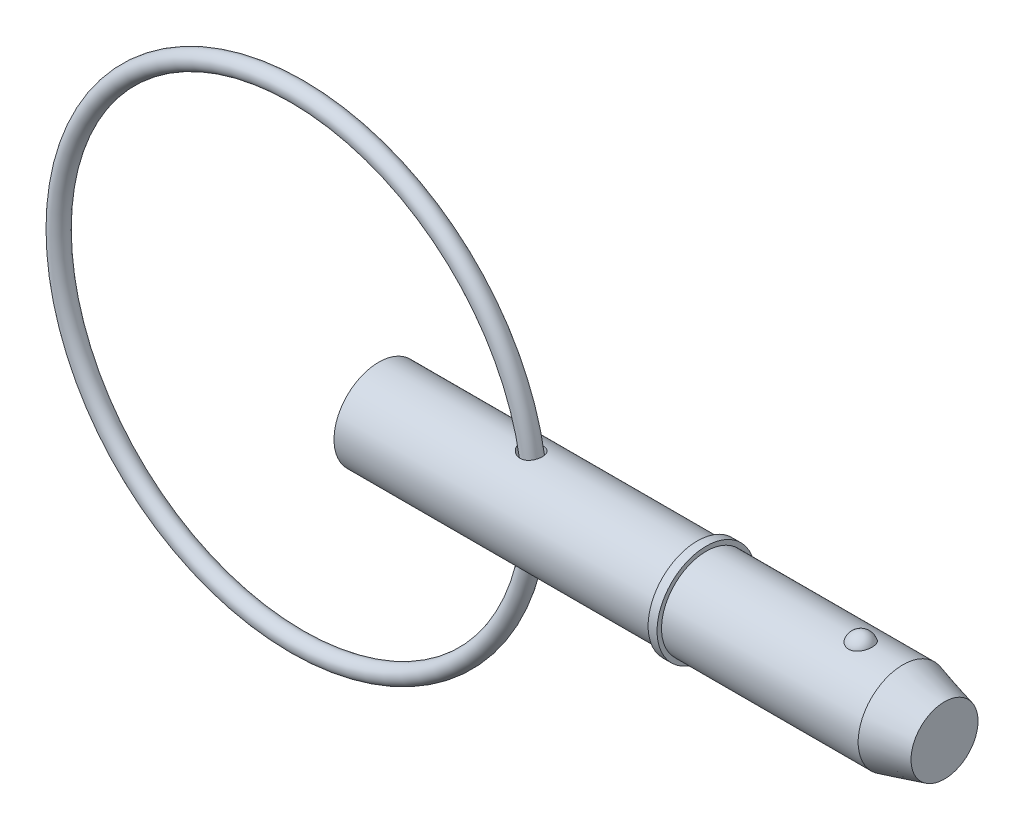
ISO-10303-21;
HEADER;
FILE_DESCRIPTION(('STEP AP214'),'2;1');
FILE_NAME('part.step','',(''),(''),'','','');
FILE_SCHEMA(('AUTOMOTIVE_DESIGN { 1 0 10303 214 1 1 1 1 }'));
ENDSEC;
DATA;
#1=APPLICATION_CONTEXT('core data for automotive mechanical design processes');
#2=APPLICATION_PROTOCOL_DEFINITION('international standard','automotive_design',2000,#1);
#3=PRODUCT_CONTEXT('',#1,'mechanical');
#4=PRODUCT('Part','Part','',(#3));
#5=PRODUCT_RELATED_PRODUCT_CATEGORY('part','',(#4));
#6=PRODUCT_DEFINITION_FORMATION('','',#4);
#7=PRODUCT_DEFINITION_CONTEXT('part definition',#1,'design');
#8=PRODUCT_DEFINITION('design','',#6,#7);
#9=PRODUCT_DEFINITION_SHAPE('','',#8);
#10=(LENGTH_UNIT() NAMED_UNIT(*) SI_UNIT(.MILLI.,.METRE.));
#11=(NAMED_UNIT(*) PLANE_ANGLE_UNIT() SI_UNIT($,.RADIAN.));
#12=(NAMED_UNIT(*) SI_UNIT($,.STERADIAN.) SOLID_ANGLE_UNIT());
#13=UNCERTAINTY_MEASURE_WITH_UNIT(LENGTH_MEASURE(1.E-05),#10,'distance_accuracy_value','');
#14=(GEOMETRIC_REPRESENTATION_CONTEXT(3) GLOBAL_UNCERTAINTY_ASSIGNED_CONTEXT((#13)) GLOBAL_UNIT_ASSIGNED_CONTEXT((#10,
#11,#12)) REPRESENTATION_CONTEXT('',''));
#15=CARTESIAN_POINT('',(0.,0.,0.));
#16=DIRECTION('',(0.,0.,1.));
#17=DIRECTION('',(1.,0.,0.));
#18=AXIS2_PLACEMENT_3D('',#15,#16,#17);
#19=CARTESIAN_POINT('',(-4.3552379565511,0.,0.));
#20=DIRECTION('',(0.,0.,1.));
#21=DIRECTION('',(1.,0.,0.));
#22=AXIS2_PLACEMENT_3D('',#19,#20,#21);
#23=TOROIDAL_SURFACE('',#22,12.7,0.476000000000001);
#24=CARTESIAN_POINT('',(8.8207620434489,0.,0.));
#25=VERTEX_POINT('',#24);
#26=VERTEX_LOOP('',#25);
#27=FACE_BOUND('',#26,.T.);
#28=ADVANCED_FACE('P0_F12',(#27),#23,.T.);
#29=CLOSED_SHELL('',(#28));
#30=MANIFOLD_SOLID_BREP('P0_B1',#29);
#31=CARTESIAN_POINT('',(0.,0.,0.));
#32=DIRECTION('',(1.,0.,0.));
#33=DIRECTION('',(0.,0.,-1.));
#34=AXIS2_PLACEMENT_3D('',#31,#32,#33);
#35=CYLINDRICAL_SURFACE('',#34,2.38);
#36=CARTESIAN_POINT('',(7.65248265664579,2.35074198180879,-0.372037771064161));
#37=CARTESIAN_POINT('',(7.67546616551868,2.34644965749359,-0.399158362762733));
#38=CARTESIAN_POINT('',(7.70081651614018,2.34199234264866,-0.424274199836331));
#39=CARTESIAN_POINT('',(7.75542747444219,2.33326580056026,-0.46990771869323));
#40=CARTESIAN_POINT('',(7.78469342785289,2.32899684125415,-0.49041900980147));
#41=CARTESIAN_POINT('',(7.8462833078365,2.32114904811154,-0.526312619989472));
#42=CARTESIAN_POINT('',(7.87860537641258,2.31756979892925,-0.541698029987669));
#43=CARTESIAN_POINT('',(7.9454452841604,2.31153734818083,-0.566889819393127));
#44=CARTESIAN_POINT('',(7.97996214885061,2.30908365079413,-0.576698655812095));
#45=CARTESIAN_POINT('',(8.05000735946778,2.30564492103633,-0.590297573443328));
#46=CARTESIAN_POINT('',(8.0855275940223,2.30465036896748,-0.594126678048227));
#47=CARTESIAN_POINT('',(8.15670718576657,2.30426876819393,-0.595606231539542));
#48=CARTESIAN_POINT('',(8.1923664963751,2.30488122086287,-0.593258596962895));
#49=CARTESIAN_POINT('',(8.26077822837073,2.30759475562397,-0.582609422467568));
#50=CARTESIAN_POINT('',(8.29358437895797,2.30961492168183,-0.574631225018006));
#51=CARTESIAN_POINT('',(8.35727060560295,2.31483318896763,-0.553233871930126));
#52=CARTESIAN_POINT('',(8.38815097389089,2.31803111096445,-0.53981554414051));
#53=CARTESIAN_POINT('',(8.44618254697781,2.3251225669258,-0.508384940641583));
#54=CARTESIAN_POINT('',(8.47341743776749,2.32899254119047,-0.490521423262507));
#55=CARTESIAN_POINT('',(8.5244826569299,2.33706025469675,-0.450515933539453));
#56=CARTESIAN_POINT('',(8.54831285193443,2.34125800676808,-0.428373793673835));
#57=CARTESIAN_POINT('',(8.5921621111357,2.34956202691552,-0.38020980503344));
#58=CARTESIAN_POINT('',(8.61214543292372,2.35366715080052,-0.354155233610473));
#59=CARTESIAN_POINT('',(8.64754725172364,2.36130301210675,-0.299034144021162));
#60=CARTESIAN_POINT('',(8.66296545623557,2.36483371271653,-0.269967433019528));
#61=CARTESIAN_POINT('',(8.68903776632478,2.37098548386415,-0.209215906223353));
#62=CARTESIAN_POINT('',(8.69962580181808,2.37359383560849,-0.177501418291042));
#63=CARTESIAN_POINT('',(8.71546966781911,2.37755210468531,-0.112692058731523));
#64=CARTESIAN_POINT('',(8.72072552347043,2.37890202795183,-0.0795971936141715));
#65=CARTESIAN_POINT('',(8.72577448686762,2.38019811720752,-0.0129544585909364));
#66=CARTESIAN_POINT('',(8.72556573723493,2.38014380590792,0.0205935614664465));
#67=CARTESIAN_POINT('',(8.71968604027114,2.37863606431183,0.0871753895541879));
#68=CARTESIAN_POINT('',(8.71401506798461,2.37718262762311,0.120209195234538));
#69=CARTESIAN_POINT('',(8.69736472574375,2.37303648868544,0.184779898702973));
#70=CARTESIAN_POINT('',(8.68639268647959,2.37034549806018,0.216318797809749));
#71=CARTESIAN_POINT('',(8.65941400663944,2.36401552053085,0.277063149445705));
#72=CARTESIAN_POINT('',(8.6434071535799,2.36037649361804,0.306268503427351));
#73=CARTESIAN_POINT('',(8.60670627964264,2.35253749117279,0.361595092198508));
#74=CARTESIAN_POINT('',(8.58600040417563,2.34833610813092,0.387708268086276));
#75=CARTESIAN_POINT('',(8.54044852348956,2.33984863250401,0.436017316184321));
#76=CARTESIAN_POINT('',(8.51560272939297,2.33556254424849,0.458213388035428));
#77=CARTESIAN_POINT('',(8.46260111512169,2.32742099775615,0.497916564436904));
#78=CARTESIAN_POINT('',(8.43446763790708,2.32356294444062,0.51545294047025));
#79=CARTESIAN_POINT('',(8.37555109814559,2.31668866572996,0.545520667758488));
#80=CARTESIAN_POINT('',(8.34476845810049,2.31367230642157,0.558052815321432));
#81=CARTESIAN_POINT('',(8.28194930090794,2.30886128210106,0.57763341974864));
#82=CARTESIAN_POINT('',(8.24993988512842,2.30704826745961,0.584764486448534));
#83=CARTESIAN_POINT('',(8.18514558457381,2.30475365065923,0.593744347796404));
#84=CARTESIAN_POINT('',(8.15236068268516,2.30427207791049,0.595593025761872));
#85=CARTESIAN_POINT('',(8.08670515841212,2.30466513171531,0.594069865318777));
#86=CARTESIAN_POINT('',(8.05383545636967,2.30554895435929,0.590662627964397));
#87=CARTESIAN_POINT('',(7.98908593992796,2.30856010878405,0.578780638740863));
#88=CARTESIAN_POINT('',(7.95720636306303,2.31068773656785,0.570304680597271));
#89=CARTESIAN_POINT('',(7.89377258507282,2.31605973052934,0.54809064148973));
#90=CARTESIAN_POINT('',(7.86230095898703,2.31935100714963,0.534128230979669));
#91=CARTESIAN_POINT('',(7.80205133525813,2.32664713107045,0.501391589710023));
#92=CARTESIAN_POINT('',(7.77327429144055,2.33065222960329,0.48261566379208));
#93=CARTESIAN_POINT('',(7.7179634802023,2.3391254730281,0.439760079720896));
#94=CARTESIAN_POINT('',(7.69158313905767,2.3436062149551,0.415484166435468));
#95=CARTESIAN_POINT('',(7.64339516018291,2.35235146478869,0.362706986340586));
#96=CARTESIAN_POINT('',(7.62158727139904,2.35661598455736,0.334205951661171));
#97=CARTESIAN_POINT('',(7.58382605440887,2.36432007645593,0.274368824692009));
#98=CARTESIAN_POINT('',(7.56774982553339,2.36777633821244,0.243112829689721));
#99=CARTESIAN_POINT('',(7.54152169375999,2.3735493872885,0.178112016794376));
#100=CARTESIAN_POINT('',(7.53136536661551,2.3758670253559,0.14436907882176));
#101=CARTESIAN_POINT('',(7.51809691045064,2.37891982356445,0.0783638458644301));
#102=CARTESIAN_POINT('',(7.5144720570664,2.37976992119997,0.0462095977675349));
#103=CARTESIAN_POINT('',(7.51285288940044,2.38014795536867,-0.0182487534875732));
#104=CARTESIAN_POINT('',(7.5148575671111,2.37967612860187,-0.0505528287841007));
#105=CARTESIAN_POINT('',(7.52413867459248,2.37752661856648,-0.112617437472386));
#106=CARTESIAN_POINT('',(7.53113538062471,2.37591295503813,-0.14242285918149));
#107=CARTESIAN_POINT('',(7.5497775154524,2.37172196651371,-0.200451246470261));
#108=CARTESIAN_POINT('',(7.56142049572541,2.3691451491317,-0.228675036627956));
#109=CARTESIAN_POINT('',(7.58571901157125,2.36396321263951,-0.276620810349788));
#110=CARTESIAN_POINT('',(7.59751818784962,2.36150235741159,-0.296799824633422));
#111=CARTESIAN_POINT('',(7.62336661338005,2.35629864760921,-0.33561908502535));
#112=CARTESIAN_POINT('',(7.63741608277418,2.353555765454,-0.354259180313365));
#113=CARTESIAN_POINT('',(7.65248265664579,2.35074198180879,-0.372037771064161));
#114=B_SPLINE_CURVE_WITH_KNOTS('',3,(#36,#37,#38,#39,#40,#41,#42,#43,#44,#45,#46,#47,#48,#49,
#50,#51,#52,#53,#54,#55,#56,#57,#58,#59,#60,#61,#62,#63,#64,#65,#66,#67,#68,#69,#70,#71,#72,#73,
#74,#75,#76,#77,#78,#79,#80,#81,#82,#83,#84,#85,#86,#87,#88,#89,#90,#91,#92,#93,#94,#95,#96,#97,
#98,#99,#100,#101,#102,#103,#104,#105,#106,#107,#108,#109,#110,#111,#112,#113),.UNSPECIFIED.,
.T.,.F.,(4,2,2,2,2,2,2,2,2,2,2,2,2,2,2,2,2,2,2,2,2,2,2,2,2,2,2,2,2,2,2,2,2,2,2,2,2,2,4),(0.,
0.107335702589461,0.214819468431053,0.322238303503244,0.429609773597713,0.536277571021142,
0.642912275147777,0.743874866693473,0.844822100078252,0.942762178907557,1.04070609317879,
1.1395202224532,1.23834068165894,1.33847507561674,1.43860899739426,1.53877695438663,
1.63894536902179,1.73897565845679,1.83901017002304,1.93929990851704,2.03958453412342,
2.13922343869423,2.23884648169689,2.33691317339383,2.4349820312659,2.53371427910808,
2.63247003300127,2.73577311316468,2.83911262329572,2.94697761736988,3.05483668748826,
3.16021984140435,3.26552413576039,3.36212700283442,3.45871257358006,3.55027266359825,
3.64178456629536,3.71214035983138,3.78250304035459),.UNSPECIFIED.);
#115=CARTESIAN_POINT('',(7.65248265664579,2.35074198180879,-0.372037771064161));
#116=VERTEX_POINT('',#115);
#117=EDGE_CURVE('P1_E42',#116,#116,#114,.T.);
#118=ORIENTED_EDGE('',*,*,#117,.T.);
#119=EDGE_LOOP('',(#118));
#120=FACE_BOUND('',#119,.T.);
#121=CARTESIAN_POINT('',(0.,0.,0.));
#122=DIRECTION('',(1.,0.,0.));
#123=DIRECTION('',(0.,0.,-1.));
#124=AXIS2_PLACEMENT_3D('',#121,#122,#123);
#125=CIRCLE('',#124,2.38);
#126=CARTESIAN_POINT('',(0.,0.,-2.38));
#127=VERTEX_POINT('',#126);
#128=EDGE_CURVE('P1_E9',#127,#127,#125,.T.);
#129=ORIENTED_EDGE('',*,*,#128,.T.);
#130=EDGE_LOOP('',(#129));
#131=FACE_BOUND('',#130,.T.);
#132=CARTESIAN_POINT('',(16.974,0.,0.));
#133=DIRECTION('',(1.,0.,0.));
#134=DIRECTION('',(0.,0.,-1.));
#135=AXIS2_PLACEMENT_3D('',#132,#133,#134);
#136=CIRCLE('',#135,2.38);
#137=CARTESIAN_POINT('',(16.974,0.,-2.38));
#138=VERTEX_POINT('',#137);
#139=EDGE_CURVE('P1_E25',#138,#138,#136,.T.);
#140=ORIENTED_EDGE('',*,*,#139,.F.);
#141=EDGE_LOOP('',(#140));
#142=FACE_BOUND('',#141,.T.);
#143=CARTESIAN_POINT('',(7.65248265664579,-2.35074198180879,-0.372037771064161));
#144=CARTESIAN_POINT('',(7.63152023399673,-2.35465684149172,-0.347300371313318));
#145=CARTESIAN_POINT('',(7.61251328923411,-2.35843676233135,-0.320880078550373));
#146=CARTESIAN_POINT('',(7.57904107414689,-2.36534227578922,-0.265218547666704));
#147=CARTESIAN_POINT('',(7.56457485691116,-2.36846800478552,-0.235977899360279));
#148=CARTESIAN_POINT('',(7.54072865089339,-2.37373250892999,-0.175281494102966));
#149=CARTESIAN_POINT('',(7.53136565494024,-2.37586798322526,-0.143818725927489));
#150=CARTESIAN_POINT('',(7.51825775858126,-2.37888184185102,-0.0796854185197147));
#151=CARTESIAN_POINT('',(7.51451093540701,-2.37976065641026,-0.0470152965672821));
#152=CARTESIAN_POINT('',(7.51287230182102,-2.38014359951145,0.0167788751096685));
#153=CARTESIAN_POINT('',(7.51468714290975,-2.37971660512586,0.0478953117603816));
#154=CARTESIAN_POINT('',(7.52344977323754,-2.37768530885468,0.109352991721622));
#155=CARTESIAN_POINT('',(7.53039746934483,-2.37608102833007,0.139694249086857));
#156=CARTESIAN_POINT('',(7.54900783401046,-2.37189301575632,0.198451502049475));
#157=CARTESIAN_POINT('',(7.56061918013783,-2.36931996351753,0.226884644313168));
#158=CARTESIAN_POINT('',(7.58810377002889,-2.36345094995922,0.281524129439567));
#159=CARTESIAN_POINT('',(7.60397804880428,-2.36015481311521,0.307729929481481));
#160=CARTESIAN_POINT('',(7.64062367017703,-2.35291979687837,0.359001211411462));
#161=CARTESIAN_POINT('',(7.66164499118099,-2.34895316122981,0.383883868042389));
#162=CARTESIAN_POINT('',(7.70730875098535,-2.34094029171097,0.430056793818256));
#163=CARTESIAN_POINT('',(7.73195270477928,-2.33689402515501,0.451345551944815));
#164=CARTESIAN_POINT('',(7.78628123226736,-2.32880869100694,0.491427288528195));
#165=CARTESIAN_POINT('',(7.81620889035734,-2.32479472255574,0.509896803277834));
#166=CARTESIAN_POINT('',(7.87876464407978,-2.31758417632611,0.541729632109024));
#167=CARTESIAN_POINT('',(7.91139323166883,-2.31438774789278,0.55509201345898));
#168=CARTESIAN_POINT('',(7.97916670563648,-2.30915137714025,0.576493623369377));
#169=CARTESIAN_POINT('',(8.0143485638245,-2.30713552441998,0.584422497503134));
#170=CARTESIAN_POINT('',(8.08560438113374,-2.30465258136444,0.594140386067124));
#171=CARTESIAN_POINT('',(8.12167802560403,-2.30418495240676,0.595931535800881));
#172=CARTESIAN_POINT('',(8.19193481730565,-2.30488473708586,0.59321801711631));
#173=CARTESIAN_POINT('',(8.2261295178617,-2.30597897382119,0.588995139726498));
#174=CARTESIAN_POINT('',(8.29321509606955,-2.30956729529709,0.574762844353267));
#175=CARTESIAN_POINT('',(8.32610629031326,-2.31206103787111,0.564754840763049));
#176=CARTESIAN_POINT('',(8.38816900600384,-2.31802118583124,0.539753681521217));
#177=CARTESIAN_POINT('',(8.41743993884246,-2.32144077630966,0.52499526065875));
#178=CARTESIAN_POINT('',(8.47302365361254,-2.32890801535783,0.490807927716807));
#179=CARTESIAN_POINT('',(8.49933643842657,-2.33295566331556,0.471379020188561));
#180=CARTESIAN_POINT('',(8.54827790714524,-2.3412242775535,0.428422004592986));
#181=CARTESIAN_POINT('',(8.57091094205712,-2.34544503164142,0.40489880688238));
#182=CARTESIAN_POINT('',(8.61197038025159,-2.35360640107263,0.354387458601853));
#183=CARTESIAN_POINT('',(8.63039647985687,-2.35754699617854,0.32739905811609));
#184=CARTESIAN_POINT('',(8.66284943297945,-2.36478461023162,0.270249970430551));
#185=CARTESIAN_POINT('',(8.67680333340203,-2.36807065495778,0.240046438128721));
#186=CARTESIAN_POINT('',(8.69957181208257,-2.37356560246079,0.177668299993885));
#187=CARTESIAN_POINT('',(8.70838630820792,-2.37577448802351,0.14549366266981));
#188=CARTESIAN_POINT('',(8.72068442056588,-2.37888446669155,0.0799353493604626));
#189=CARTESIAN_POINT('',(8.72414498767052,-2.37977990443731,0.046547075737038));
#190=CARTESIAN_POINT('',(8.72557509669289,-2.38014803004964,-0.0203543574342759));
#191=CARTESIAN_POINT('',(8.72354468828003,-2.37962073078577,-0.0538675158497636));
#192=CARTESIAN_POINT('',(8.71405606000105,-2.37720346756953,-0.119981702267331));
#193=CARTESIAN_POINT('',(8.70661109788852,-2.37531683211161,-0.152584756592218));
#194=CARTESIAN_POINT('',(8.68649336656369,-2.37038779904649,-0.216044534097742));
#195=CARTESIAN_POINT('',(8.67382040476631,-2.36734535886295,-0.24690119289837));
#196=CARTESIAN_POINT('',(8.64352750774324,-2.36042700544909,-0.306062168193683));
#197=CARTESIAN_POINT('',(8.62589743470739,-2.35654938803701,-0.334361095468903));
#198=CARTESIAN_POINT('',(8.58613860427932,-2.34839114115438,-0.387535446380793));
#199=CARTESIAN_POINT('',(8.5640098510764,-2.34411051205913,-0.412410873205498));
#200=CARTESIAN_POINT('',(8.51586484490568,-2.33563475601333,-0.457982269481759));
#201=CARTESIAN_POINT('',(8.48985596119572,-2.33143948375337,-0.478685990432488));
#202=CARTESIAN_POINT('',(8.43462330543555,-2.32360655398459,-0.515369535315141));
#203=CARTESIAN_POINT('',(8.40540000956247,-2.31996881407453,-0.531350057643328));
#204=CARTESIAN_POINT('',(8.34502624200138,-2.31371771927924,-0.557938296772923));
#205=CARTESIAN_POINT('',(8.31391082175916,-2.31108995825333,-0.568622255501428));
#206=CARTESIAN_POINT('',(8.25027207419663,-2.30707117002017,-0.584715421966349));
#207=CARTESIAN_POINT('',(8.21774884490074,-2.30568005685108,-0.590124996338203));
#208=CARTESIAN_POINT('',(8.15238918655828,-2.30427145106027,-0.595601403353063));
#209=CARTESIAN_POINT('',(8.11955499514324,-2.3042474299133,-0.595693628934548));
#210=CARTESIAN_POINT('',(8.05430726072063,-2.30552664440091,-0.590722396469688));
#211=CARTESIAN_POINT('',(8.02189380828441,-2.3068301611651,-0.585657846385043));
#212=CARTESIAN_POINT('',(7.95720150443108,-2.31066076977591,-0.570360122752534));
#213=CARTESIAN_POINT('',(7.92496602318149,-2.31322859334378,-0.55995436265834));
#214=CARTESIAN_POINT('',(7.86260707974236,-2.31930140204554,-0.534242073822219));
#215=CARTESIAN_POINT('',(7.83248403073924,-2.32280656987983,-0.518934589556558));
#216=CARTESIAN_POINT('',(7.77533132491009,-2.33034138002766,-0.483968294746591));
#217=CARTESIAN_POINT('',(7.74827623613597,-2.33436601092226,-0.464349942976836));
#218=CARTESIAN_POINT('',(7.69762060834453,-2.34255524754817,-0.4210920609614));
#219=CARTESIAN_POINT('',(7.67401956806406,-2.34671983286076,-0.397453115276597));
#220=CARTESIAN_POINT('',(7.65248265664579,-2.35074198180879,-0.372037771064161));
#221=B_SPLINE_CURVE_WITH_KNOTS('',3,(#143,#144,#145,#146,#147,#148,#149,#150,#151,#152,#153,
#154,#155,#156,#157,#158,#159,#160,#161,#162,#163,#164,#165,#166,#167,#168,#169,#170,#171,#172,
#173,#174,#175,#176,#177,#178,#179,#180,#181,#182,#183,#184,#185,#186,#187,#188,#189,#190,#191,
#192,#193,#194,#195,#196,#197,#198,#199,#200,#201,#202,#203,#204,#205,#206,#207,#208,#209,#210,
#211,#212,#213,#214,#215,#216,#217,#218,#219,#220),.UNSPECIFIED.,.T.,.F.,(4,2,2,2,2,2,2,2,2,2,2,
2,2,2,2,2,2,2,2,2,2,2,2,2,2,2,2,2,2,2,2,2,2,2,2,2,2,2,4),(0.,0.0978755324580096,
0.19573064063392,0.293909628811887,0.39205499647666,0.48511441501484,0.578172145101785,
0.670232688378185,0.762315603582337,0.860342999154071,0.958411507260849,1.06411708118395,
1.16984195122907,1.27765506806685,1.38543067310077,1.48831936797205,1.59118291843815,
1.68959047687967,1.78799793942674,1.88628818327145,1.98458551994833,2.08441314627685,
2.18424236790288,2.28450017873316,2.38475708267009,2.48476932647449,2.58478525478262,
2.68500723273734,2.78522911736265,2.88526302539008,2.98528213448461,3.08381637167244,
3.18234375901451,3.28040059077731,3.37847819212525,3.4799455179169,3.58143263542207,
3.68200512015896,3.78256299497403),.UNSPECIFIED.);
#222=CARTESIAN_POINT('',(7.65248265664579,-2.35074198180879,-0.372037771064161));
#223=VERTEX_POINT('',#222);
#224=EDGE_CURVE('P1_E17',#223,#223,#221,.T.);
#225=ORIENTED_EDGE('',*,*,#224,.T.);
#226=EDGE_LOOP('',(#225));
#227=FACE_BOUND('',#226,.T.);
#228=ADVANCED_FACE('P1_F13',(#120,#131,#142,#227),#35,.T.);
#229=CARTESIAN_POINT('',(0.,0.,0.));
#230=DIRECTION('',(1.,0.,0.));
#231=DIRECTION('',(0.,0.,-1.));
#232=AXIS2_PLACEMENT_3D('',#229,#230,#231);
#233=CYLINDRICAL_SURFACE('',#232,2.38);
#234=CARTESIAN_POINT('',(27.9294297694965,0.,0.));
#235=DIRECTION('',(1.,0.,0.));
#236=DIRECTION('',(0.,0.,-1.));
#237=AXIS2_PLACEMENT_3D('',#234,#235,#236);
#238=CIRCLE('',#237,2.38);
#239=CARTESIAN_POINT('',(27.9294297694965,0.,-2.38));
#240=VERTEX_POINT('',#239);
#241=EDGE_CURVE('P1_E99',#240,#240,#238,.T.);
#242=ORIENTED_EDGE('',*,*,#241,.F.);
#243=EDGE_LOOP('',(#242));
#244=FACE_BOUND('',#243,.T.);
#245=CARTESIAN_POINT('',(17.45,0.,0.));
#246=DIRECTION('',(1.,0.,0.));
#247=DIRECTION('',(0.,0.,-1.));
#248=AXIS2_PLACEMENT_3D('',#245,#246,#247);
#249=CIRCLE('',#248,2.38);
#250=CARTESIAN_POINT('',(17.45,0.,-2.38));
#251=VERTEX_POINT('',#250);
#252=EDGE_CURVE('P1_E96',#251,#251,#249,.T.);
#253=ORIENTED_EDGE('',*,*,#252,.T.);
#254=EDGE_LOOP('',(#253));
#255=FACE_BOUND('',#254,.T.);
#256=CARTESIAN_POINT('',(25.6834492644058,2.2921568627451,0.640637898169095));
#257=CARTESIAN_POINT('',(25.6503559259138,2.29215737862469,0.640637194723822));
#258=CARTESIAN_POINT('',(25.6172546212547,2.29293179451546,0.637884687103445));
#259=CARTESIAN_POINT('',(25.5520176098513,2.29594030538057,0.626968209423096));
#260=CARTESIAN_POINT('',(25.5198823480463,2.29817506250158,0.618801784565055));
#261=CARTESIAN_POINT('',(25.4575402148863,2.3038430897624,0.597351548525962));
#262=CARTESIAN_POINT('',(25.4273305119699,2.30727454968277,0.584075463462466));
#263=CARTESIAN_POINT('',(25.3695674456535,2.31495941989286,0.552829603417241));
#264=CARTESIAN_POINT('',(25.3420141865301,2.31921286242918,0.534859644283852));
#265=CARTESIAN_POINT('',(25.289593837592,2.32820213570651,0.494282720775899));
#266=CARTESIAN_POINT('',(25.2648050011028,2.33294694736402,0.471576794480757));
#267=CARTESIAN_POINT('',(25.2192169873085,2.34234144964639,0.422446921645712));
#268=CARTESIAN_POINT('',(25.1984185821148,2.34699112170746,0.396022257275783));
#269=CARTESIAN_POINT('',(25.1603580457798,2.35593942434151,0.338855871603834));
#270=CARTESIAN_POINT('',(25.1433051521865,2.36021170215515,0.30797060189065));
#271=CARTESIAN_POINT('',(25.1143607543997,2.3677057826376,0.243750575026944));
#272=CARTESIAN_POINT('',(25.1024701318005,2.37092740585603,0.210415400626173));
#273=CARTESIAN_POINT('',(25.0838076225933,2.37606901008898,0.141189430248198));
#274=CARTESIAN_POINT('',(25.0771956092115,2.37794816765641,0.105252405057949));
#275=CARTESIAN_POINT('',(25.0698095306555,2.38005135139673,0.0327351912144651));
#276=CARTESIAN_POINT('',(25.0690358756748,2.38027526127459,-0.00384504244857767));
#277=CARTESIAN_POINT('',(25.0733628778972,2.37903842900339,-0.0769838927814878));
#278=CARTESIAN_POINT('',(25.0785202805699,2.37756141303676,-0.113538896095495));
#279=CARTESIAN_POINT('',(25.094701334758,2.37305303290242,-0.185229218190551));
#280=CARTESIAN_POINT('',(25.1057251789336,2.37002161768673,-0.22036449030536));
#281=CARTESIAN_POINT('',(25.1333977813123,2.36273722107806,-0.28815667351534));
#282=CARTESIAN_POINT('',(25.1500389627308,2.35848588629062,-0.320816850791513));
#283=CARTESIAN_POINT('',(25.1885984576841,2.34923130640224,-0.382744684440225));
#284=CARTESIAN_POINT('',(25.210516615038,2.34422808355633,-0.412012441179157));
#285=CARTESIAN_POINT('',(25.2587549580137,2.33412555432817,-0.465830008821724));
#286=CARTESIAN_POINT('',(25.2850028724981,2.32902887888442,-0.490444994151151));
#287=CARTESIAN_POINT('',(25.3414769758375,2.31926941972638,-0.53470032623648));
#288=CARTESIAN_POINT('',(25.3717022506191,2.31460653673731,-0.554341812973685));
#289=CARTESIAN_POINT('',(25.4340618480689,2.30645675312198,-0.587312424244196));
#290=CARTESIAN_POINT('',(25.4660780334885,2.30293152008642,-0.600855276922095));
#291=CARTESIAN_POINT('',(25.5320795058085,2.29725171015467,-0.62222045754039));
#292=CARTESIAN_POINT('',(25.5660641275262,2.29509667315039,-0.63004470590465));
#293=CARTESIAN_POINT('',(25.633299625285,2.29249264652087,-0.639452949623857));
#294=CARTESIAN_POINT('',(25.6665087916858,2.29196755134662,-0.64131544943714));
#295=CARTESIAN_POINT('',(25.732763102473,2.29246849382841,-0.639522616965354));
#296=CARTESIAN_POINT('',(25.7658082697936,2.29349430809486,-0.635868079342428));
#297=CARTESIAN_POINT('',(25.8301025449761,2.29694059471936,-0.623301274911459));
#298=CARTESIAN_POINT('',(25.8613744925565,2.29933234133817,-0.614497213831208));
#299=CARTESIAN_POINT('',(25.9219952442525,2.30522511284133,-0.592006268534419));
#300=CARTESIAN_POINT('',(25.9513438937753,2.30872622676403,-0.578318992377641));
#301=CARTESIAN_POINT('',(26.0080369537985,2.31655795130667,-0.54611257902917));
#302=CARTESIAN_POINT('',(26.035320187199,2.32090569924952,-0.527490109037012));
#303=CARTESIAN_POINT('',(26.0864904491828,2.3299220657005,-0.486117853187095));
#304=CARTESIAN_POINT('',(26.1103767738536,2.33459075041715,-0.463367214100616));
#305=CARTESIAN_POINT('',(26.1552722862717,2.34399834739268,-0.413220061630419));
#306=CARTESIAN_POINT('',(26.1760972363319,2.34873051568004,-0.385657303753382));
#307=CARTESIAN_POINT('',(26.213056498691,2.35754932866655,-0.327455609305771));
#308=CARTESIAN_POINT('',(26.2291898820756,2.36163584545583,-0.296816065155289));
#309=CARTESIAN_POINT('',(26.2569822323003,2.36889321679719,-0.232047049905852));
#310=CARTESIAN_POINT('',(26.2684450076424,2.37202275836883,-0.197828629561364));
#311=CARTESIAN_POINT('',(26.2857523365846,2.37681926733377,-0.127900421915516));
#312=CARTESIAN_POINT('',(26.2915962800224,2.37848607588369,-0.0921904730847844));
#313=CARTESIAN_POINT('',(26.297605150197,2.38020024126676,-0.0196348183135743));
#314=CARTESIAN_POINT('',(26.2976704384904,2.38021918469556,0.0172198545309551));
#315=CARTESIAN_POINT('',(26.2918689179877,2.37856356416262,0.090421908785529));
#316=CARTESIAN_POINT('',(26.2860018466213,2.37688892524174,0.126769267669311));
#317=CARTESIAN_POINT('',(26.268425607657,2.37201688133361,0.198028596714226));
#318=CARTESIAN_POINT('',(26.2566998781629,2.36881516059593,0.232936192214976));
#319=CARTESIAN_POINT('',(26.2276354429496,2.36123444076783,0.300196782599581));
#320=CARTESIAN_POINT('',(26.2102967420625,2.3568554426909,0.332549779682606));
#321=CARTESIAN_POINT('',(26.1705350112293,2.34744667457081,0.393495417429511));
#322=CARTESIAN_POINT('',(26.1481528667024,2.34242227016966,0.422115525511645));
#323=CARTESIAN_POINT('',(26.0987391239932,2.33227293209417,0.475004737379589));
#324=CARTESIAN_POINT('',(26.0717076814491,2.32714800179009,0.499273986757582));
#325=CARTESIAN_POINT('',(26.0144988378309,2.31755359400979,0.542046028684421));
#326=CARTESIAN_POINT('',(25.9844297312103,2.3130698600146,0.560690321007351));
#327=CARTESIAN_POINT('',(25.9213869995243,2.30514125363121,0.592447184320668));
#328=CARTESIAN_POINT('',(25.8884158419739,2.30169550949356,0.605564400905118));
#329=CARTESIAN_POINT('',(25.8268424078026,2.29677744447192,0.623927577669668));
#330=CARTESIAN_POINT('',(25.7985555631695,2.295058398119,0.630178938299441));
#331=CARTESIAN_POINT('',(25.7413308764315,2.29274795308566,0.63853414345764));
#332=CARTESIAN_POINT('',(25.7123931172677,2.29215641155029,0.640638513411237));
#333=CARTESIAN_POINT('',(25.6834492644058,2.2921568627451,0.640637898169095));
#334=B_SPLINE_CURVE_WITH_KNOTS('',3,(#256,#257,#258,#259,#260,#261,#262,#263,#264,#265,#266,
#267,#268,#269,#270,#271,#272,#273,#274,#275,#276,#277,#278,#279,#280,#281,#282,#283,#284,#285,
#286,#287,#288,#289,#290,#291,#292,#293,#294,#295,#296,#297,#298,#299,#300,#301,#302,#303,#304,
#305,#306,#307,#308,#309,#310,#311,#312,#313,#314,#315,#316,#317,#318,#319,#320,#321,#322,#323,
#324,#325,#326,#327,#328,#329,#330,#331,#332,#333),.UNSPECIFIED.,.T.,.F.,(4,2,2,2,2,2,2,2,2,2,2,
2,2,2,2,2,2,2,2,2,2,2,2,2,2,2,2,2,2,2,2,2,2,2,2,2,2,2,4),(0.,0.099172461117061,
0.198389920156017,0.297457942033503,0.396529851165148,0.497927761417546,0.599345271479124,
0.705475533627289,0.811623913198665,0.92087671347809,1.03013718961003,1.14045177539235,
1.2507699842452,1.36093998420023,1.47110672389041,1.57959248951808,1.68805336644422,
1.79234266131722,1.89659691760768,1.99590391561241,2.09519661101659,2.19247425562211,
2.28975970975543,2.38926978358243,2.4888004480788,2.59293588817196,2.69709193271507,
2.80525821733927,2.91343624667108,3.02347917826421,3.1335269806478,3.24388765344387,
3.35424823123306,3.46374443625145,3.5732369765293,3.67968690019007,3.78604717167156,
3.87279565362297,3.95953314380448),.UNSPECIFIED.);
#335=CARTESIAN_POINT('',(25.6834492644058,2.2921568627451,0.640637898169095));
#336=VERTEX_POINT('',#335);
#337=EDGE_CURVE('P1_E34',#336,#336,#334,.T.);
#338=ORIENTED_EDGE('',*,*,#337,.T.);
#339=EDGE_LOOP('',(#338));
#340=FACE_BOUND('',#339,.T.);
#341=ADVANCED_FACE('P1_F46',(#244,#255,#340),#233,.T.);
#342=CARTESIAN_POINT('',(0.,0.,0.));
#343=DIRECTION('',(-1.,0.,0.));
#344=DIRECTION('',(0.,0.,1.));
#345=AXIS2_PLACEMENT_3D('',#342,#343,#344);
#346=PLANE('',#345);
#347=ORIENTED_EDGE('',*,*,#128,.F.);
#348=EDGE_LOOP('',(#347));
#349=FACE_BOUND('',#348,.T.);
#350=ADVANCED_FACE('P1_F15',(#349),#346,.T.);
#351=CARTESIAN_POINT('',(16.974,2.38,0.));
#352=DIRECTION('',(-1.,0.,0.));
#353=DIRECTION('',(0.,0.,1.));
#354=AXIS2_PLACEMENT_3D('',#351,#352,#353);
#355=PLANE('',#354);
#356=ORIENTED_EDGE('',*,*,#139,.T.);
#357=EDGE_LOOP('',(#356));
#358=FACE_BOUND('',#357,.T.);
#359=CARTESIAN_POINT('',(16.974,0.,0.));
#360=DIRECTION('',(1.,0.,0.));
#361=DIRECTION('',(0.,0.,-1.));
#362=AXIS2_PLACEMENT_3D('',#359,#360,#361);
#363=CIRCLE('',#362,2.618);
#364=CARTESIAN_POINT('',(16.974,0.,-2.618));
#365=VERTEX_POINT('',#364);
#366=EDGE_CURVE('P1_E30',#365,#365,#363,.T.);
#367=ORIENTED_EDGE('',*,*,#366,.F.);
#368=EDGE_LOOP('',(#367));
#369=FACE_BOUND('',#368,.T.);
#370=ADVANCED_FACE('P1_F81',(#358,#369),#355,.T.);
#371=CARTESIAN_POINT('',(0.,0.,0.));
#372=DIRECTION('',(1.,0.,0.));
#373=DIRECTION('',(0.,0.,-1.));
#374=AXIS2_PLACEMENT_3D('',#371,#372,#373);
#375=CYLINDRICAL_SURFACE('',#374,2.618);
#376=ORIENTED_EDGE('',*,*,#366,.T.);
#377=EDGE_LOOP('',(#376));
#378=FACE_BOUND('',#377,.T.);
#379=CARTESIAN_POINT('',(17.45,0.,0.));
#380=DIRECTION('',(1.,0.,0.));
#381=DIRECTION('',(0.,0.,-1.));
#382=AXIS2_PLACEMENT_3D('',#379,#380,#381);
#383=CIRCLE('',#382,2.618);
#384=CARTESIAN_POINT('',(17.45,0.,-2.618));
#385=VERTEX_POINT('',#384);
#386=EDGE_CURVE('P1_E95',#385,#385,#383,.T.);
#387=ORIENTED_EDGE('',*,*,#386,.F.);
#388=EDGE_LOOP('',(#387));
#389=FACE_BOUND('',#388,.T.);
#390=ADVANCED_FACE('P1_F68',(#378,#389),#375,.T.);
#391=CARTESIAN_POINT('',(17.45,2.618,0.));
#392=DIRECTION('',(1.,0.,0.));
#393=DIRECTION('',(0.,0.,-1.));
#394=AXIS2_PLACEMENT_3D('',#391,#392,#393);
#395=PLANE('',#394);
#396=ORIENTED_EDGE('',*,*,#386,.T.);
#397=EDGE_LOOP('',(#396));
#398=FACE_BOUND('',#397,.T.);
#399=ORIENTED_EDGE('',*,*,#252,.F.);
#400=EDGE_LOOP('',(#399));
#401=FACE_BOUND('',#400,.T.);
#402=ADVANCED_FACE('P1_F62',(#398,#401),#395,.T.);
#403=CARTESIAN_POINT('',(30.15,0.,0.));
#404=DIRECTION('',(-1.,0.,0.));
#405=DIRECTION('',(0.,0.,1.));
#406=AXIS2_PLACEMENT_3D('',#403,#404,#405);
#407=CONICAL_SURFACE('',#406,1.785,0.26179938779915);
#408=ORIENTED_EDGE('',*,*,#241,.T.);
#409=EDGE_LOOP('',(#408));
#410=FACE_BOUND('',#409,.T.);
#411=CARTESIAN_POINT('',(30.15,0.,0.));
#412=DIRECTION('',(1.,0.,0.));
#413=DIRECTION('',(0.,0.,-1.));
#414=AXIS2_PLACEMENT_3D('',#411,#412,#413);
#415=CIRCLE('',#414,1.785);
#416=CARTESIAN_POINT('',(30.15,0.,-1.785));
#417=VERTEX_POINT('',#416);
#418=EDGE_CURVE('P1_E41',#417,#417,#415,.T.);
#419=ORIENTED_EDGE('',*,*,#418,.F.);
#420=EDGE_LOOP('',(#419));
#421=FACE_BOUND('',#420,.T.);
#422=ADVANCED_FACE('P1_F59',(#410,#421),#407,.T.);
#423=CARTESIAN_POINT('',(30.15,1.785,0.));
#424=DIRECTION('',(1.,0.,0.));
#425=DIRECTION('',(0.,0.,-1.));
#426=AXIS2_PLACEMENT_3D('',#423,#424,#425);
#427=PLANE('',#426);
#428=ORIENTED_EDGE('',*,*,#418,.T.);
#429=EDGE_LOOP('',(#428));
#430=FACE_BOUND('',#429,.T.);
#431=ADVANCED_FACE('P1_F55',(#430),#427,.T.);
#432=CARTESIAN_POINT('',(25.6834492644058,2.14199999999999,0.));
#433=DIRECTION('',(-1.,0.,0.));
#434=DIRECTION('',(0.,-1.,0.));
#435=AXIS2_PLACEMENT_3D('',#432,#433,#434);
#436=SPHERICAL_SURFACE('',#435,0.657999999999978);
#437=ORIENTED_EDGE('',*,*,#337,.F.);
#438=EDGE_LOOP('',(#437));
#439=FACE_BOUND('',#438,.T.);
#440=ADVANCED_FACE('P1_F50',(#439),#436,.T.);
#441=CARTESIAN_POINT('',(-4.3552379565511,0.,0.));
#442=DIRECTION('',(0.,0.,1.));
#443=DIRECTION('',(1.,0.,0.));
#444=AXIS2_PLACEMENT_3D('',#441,#442,#443);
#445=TOROIDAL_SURFACE('',#444,12.7,0.594999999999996);
#446=ORIENTED_EDGE('',*,*,#224,.F.);
#447=EDGE_LOOP('',(#446));
#448=FACE_BOUND('',#447,.T.);
#449=ORIENTED_EDGE('',*,*,#117,.F.);
#450=EDGE_LOOP('',(#449));
#451=FACE_BOUND('',#450,.T.);
#452=ADVANCED_FACE('P1_F54',(#448,#451),#445,.F.);
#453=CLOSED_SHELL('',(#228,#341,#350,#370,#390,#402,#422,#431,#440,#452));
#454=MANIFOLD_SOLID_BREP('P1_B1',#453);
#455=ADVANCED_BREP_SHAPE_REPRESENTATION('',(#18,#30,#454),#14);
#456=SHAPE_DEFINITION_REPRESENTATION(#9,#455);
ENDSEC;
END-ISO-10303-21;
